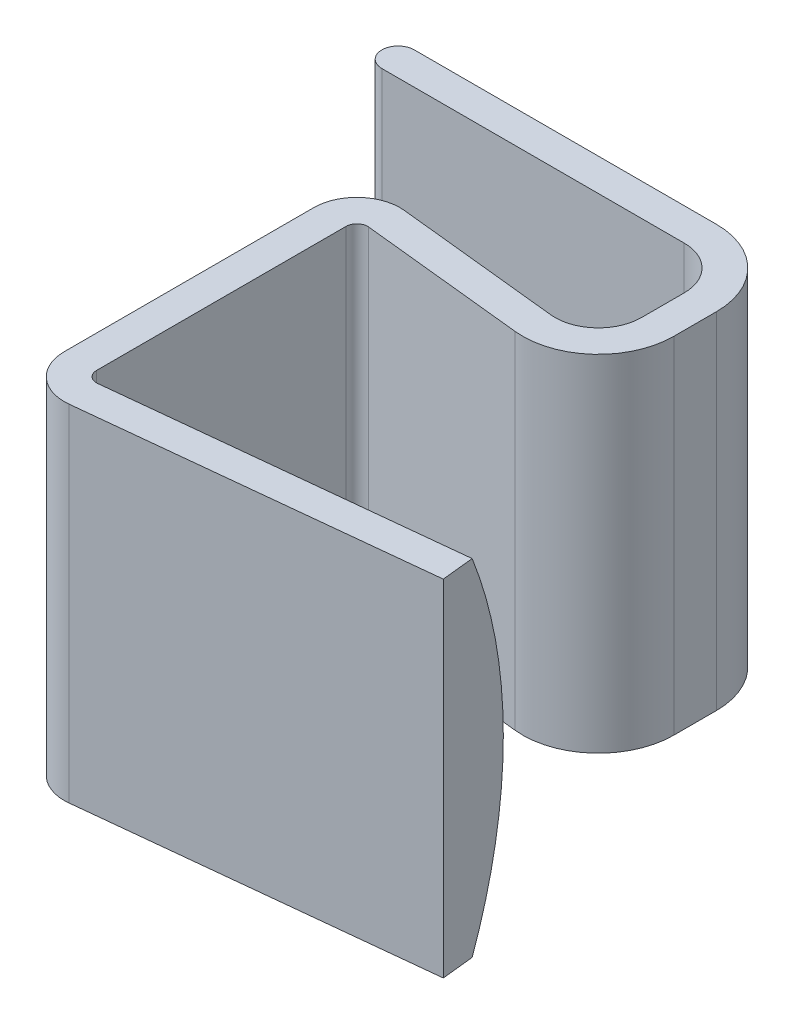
ISO-10303-21;
HEADER;
FILE_DESCRIPTION(('STEP AP214'),'2;1');
FILE_NAME('part.step','',(''),(''),'','','');
FILE_SCHEMA(('AUTOMOTIVE_DESIGN { 1 0 10303 214 1 1 1 1 }'));
ENDSEC;
DATA;
#1=APPLICATION_CONTEXT('core data for automotive mechanical design processes');
#2=APPLICATION_PROTOCOL_DEFINITION('international standard','automotive_design',2000,#1);
#3=PRODUCT_CONTEXT('',#1,'mechanical');
#4=PRODUCT('Part','Part','',(#3));
#5=PRODUCT_RELATED_PRODUCT_CATEGORY('part','',(#4));
#6=PRODUCT_DEFINITION_FORMATION('','',#4);
#7=PRODUCT_DEFINITION_CONTEXT('part definition',#1,'design');
#8=PRODUCT_DEFINITION('design','',#6,#7);
#9=PRODUCT_DEFINITION_SHAPE('','',#8);
#10=(LENGTH_UNIT() NAMED_UNIT(*) SI_UNIT(.MILLI.,.METRE.));
#11=(NAMED_UNIT(*) PLANE_ANGLE_UNIT() SI_UNIT($,.RADIAN.));
#12=(NAMED_UNIT(*) SI_UNIT($,.STERADIAN.) SOLID_ANGLE_UNIT());
#13=UNCERTAINTY_MEASURE_WITH_UNIT(LENGTH_MEASURE(1.E-05),#10,'distance_accuracy_value','');
#14=(GEOMETRIC_REPRESENTATION_CONTEXT(3) GLOBAL_UNCERTAINTY_ASSIGNED_CONTEXT((#13)) GLOBAL_UNIT_ASSIGNED_CONTEXT((#10,
#11,#12)) REPRESENTATION_CONTEXT('',''));
#15=CARTESIAN_POINT('',(0.,0.,0.));
#16=DIRECTION('',(0.,0.,1.));
#17=DIRECTION('',(1.,0.,0.));
#18=AXIS2_PLACEMENT_3D('',#15,#16,#17);
#19=CARTESIAN_POINT('',(19.1345715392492,50.8,8.59003879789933));
#20=DIRECTION('',(0.,-1.,0.));
#21=DIRECTION('',(0.,0.,-1.));
#22=AXIS2_PLACEMENT_3D('',#19,#20,#21);
#23=CYLINDRICAL_SURFACE('',#22,1.5875);
#24=DIRECTION('',(0.,-1.,0.));
#25=VECTOR('',#24,1.);
#26=CARTESIAN_POINT('',(17.5470715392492,50.8,8.59003879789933));
#27=LINE('',#26,#25);
#28=CARTESIAN_POINT('',(17.5470715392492,4.62567107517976,8.59003879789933));
#29=VERTEX_POINT('',#28);
#30=CARTESIAN_POINT('',(17.5470715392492,0.,8.59003879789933));
#31=VERTEX_POINT('',#30);
#32=EDGE_CURVE('E193',#29,#31,#27,.T.);
#33=ORIENTED_EDGE('',*,*,#32,.F.);
#34=CARTESIAN_POINT('',(19.3005104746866,-1.90819582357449E-13,10.1688423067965));
#35=CARTESIAN_POINT('',(19.2619629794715,-9.98065341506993E-05,10.1729373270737));
#36=CARTESIAN_POINT('',(19.2234032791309,0.00335050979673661,10.1755210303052));
#37=CARTESIAN_POINT('',(19.1477266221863,0.0164155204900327,10.1779183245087));
#38=CARTESIAN_POINT('',(19.1105976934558,0.0259531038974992,10.1777659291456));
#39=CARTESIAN_POINT('',(19.0294241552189,0.0532645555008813,10.1746984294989));
#40=CARTESIAN_POINT('',(18.9859000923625,0.0724794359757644,10.171118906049));
#41=CARTESIAN_POINT('',(18.9023247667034,0.117043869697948,10.1610256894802));
#42=CARTESIAN_POINT('',(18.8622929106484,0.142425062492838,10.1544967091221));
#43=CARTESIAN_POINT('',(18.7615667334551,0.215076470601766,10.1344168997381));
#44=CARTESIAN_POINT('',(18.7039118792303,0.266005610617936,10.1190406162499));
#45=CARTESIAN_POINT('',(18.5968204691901,0.374679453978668,10.084744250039));
#46=CARTESIAN_POINT('',(18.5474008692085,0.432437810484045,10.0658170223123));
#47=CARTESIAN_POINT('',(18.453314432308,0.55467142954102,10.0248824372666));
#48=CARTESIAN_POINT('',(18.4089236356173,0.619324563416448,10.0027809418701));
#49=CARTESIAN_POINT('',(18.3259049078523,0.751722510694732,9.95695560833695));
#50=CARTESIAN_POINT('',(18.2872832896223,0.819470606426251,9.93323003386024));
#51=CARTESIAN_POINT('',(18.2147321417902,0.957255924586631,9.88462785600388));
#52=CARTESIAN_POINT('',(18.1808150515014,1.02729863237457,9.85974842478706));
#53=CARTESIAN_POINT('',(18.1170524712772,1.16889013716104,9.80924413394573));
#54=CARTESIAN_POINT('',(18.0872051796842,1.24043825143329,9.78361961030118));
#55=CARTESIAN_POINT('',(18.0166906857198,1.42136800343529,9.71867941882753));
#56=CARTESIAN_POINT('',(17.9782377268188,1.53149033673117,9.67902663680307));
#57=CARTESIAN_POINT('',(17.9078151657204,1.75356389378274,9.59902764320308));
#58=CARTESIAN_POINT('',(17.8758485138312,1.86551592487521,9.55868112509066));
#59=CARTESIAN_POINT('',(17.8173942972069,2.09089137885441,9.47756532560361));
#60=CARTESIAN_POINT('',(17.7909154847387,2.20431685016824,9.4367954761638));
#61=CARTESIAN_POINT('',(17.7427875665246,2.43214349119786,9.3551111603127));
#62=CARTESIAN_POINT('',(17.7211392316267,2.54654481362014,9.31419667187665));
#63=CARTESIAN_POINT('',(17.6625450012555,2.89123285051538,9.19134283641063));
#64=CARTESIAN_POINT('',(17.6320416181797,3.12263337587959,9.10942691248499));
#65=CARTESIAN_POINT('',(17.5853152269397,3.5868984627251,8.94656496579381));
#66=CARTESIAN_POINT('',(17.5690788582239,3.81976144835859,8.8656181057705));
#67=CARTESIAN_POINT('',(17.5550607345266,4.14856023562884,8.75249628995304));
#68=CARTESIAN_POINT('',(17.5520432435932,4.24410691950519,8.71976303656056));
#69=CARTESIAN_POINT('',(17.5480532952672,4.43497746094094,8.65465716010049));
#70=CARTESIAN_POINT('',(17.5470734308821,4.53030086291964,8.62228365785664));
#71=CARTESIAN_POINT('',(17.5470715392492,4.62567107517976,8.59003879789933));
#72=B_SPLINE_CURVE_WITH_KNOTS('',3,(#34,#35,#36,#37,#38,#39,#40,#41,#42,#43,#44,#45,#46,#47,#48,
#49,#50,#51,#52,#53,#54,#55,#56,#57,#58,#59,#60,#61,#62,#63,#64,#65,#66,#67,#68,#69,#70,#71),
.UNSPECIFIED.,.F.,.F.,(4,2,2,2,2,2,2,2,2,2,2,2,2,2,2,2,2,2,4),(0.,0.115877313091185,
0.23031511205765,0.372649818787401,0.515730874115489,0.74975503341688,0.984255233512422,
1.22831934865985,1.47264860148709,1.71761205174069,1.96246670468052,2.33181097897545,
2.70132287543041,3.07141962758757,3.44157539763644,4.1830966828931,4.92392281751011,
5.22703606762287,5.52904552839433),.UNSPECIFIED.);
#73=CARTESIAN_POINT('',(19.3005104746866,0.,10.1688423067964));
#74=VERTEX_POINT('',#73);
#75=EDGE_CURVE('E192',#74,#29,#72,.T.);
#76=ORIENTED_EDGE('',*,*,#75,.F.);
#77=CARTESIAN_POINT('',(19.1345715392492,0.,8.59003879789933));
#78=DIRECTION('',(0.,-1.,0.));
#79=DIRECTION('',(0.,0.,1.));
#80=AXIS2_PLACEMENT_3D('',#77,#78,#79);
#81=CIRCLE('',#80,1.5875);
#82=EDGE_CURVE('E179',#74,#31,#81,.T.);
#83=ORIENTED_EDGE('',*,*,#82,.T.);
#84=EDGE_LOOP('',(#33,#76,#83));
#85=FACE_BOUND('',#84,.T.);
#86=ADVANCED_FACE('F33',(#85),#23,.F.);
#87=CARTESIAN_POINT('',(0.0845715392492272,50.8,-53.219350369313));
#88=DIRECTION('',(0.,-1.,0.));
#89=DIRECTION('',(0.,0.,-1.));
#90=AXIS2_PLACEMENT_3D('',#87,#88,#89);
#91=CYLINDRICAL_SURFACE('',#90,2.38125);
#92=CARTESIAN_POINT('',(0.0845715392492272,0.,-53.219350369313));
#93=DIRECTION('',(0.,1.,0.));
#94=DIRECTION('',(0.,0.,-1.));
#95=AXIS2_PLACEMENT_3D('',#92,#93,#94);
#96=CIRCLE('',#95,2.38125);
#97=CARTESIAN_POINT('',(0.0845715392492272,0.,-55.600600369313));
#98=VERTEX_POINT('',#97);
#99=CARTESIAN_POINT('',(0.0845715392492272,0.,-50.838100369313));
#100=VERTEX_POINT('',#99);
#101=EDGE_CURVE('E284',#98,#100,#96,.T.);
#102=ORIENTED_EDGE('',*,*,#101,.T.);
#103=DIRECTION('',(0.,-1.,0.));
#104=VECTOR('',#103,1.);
#105=CARTESIAN_POINT('',(0.0845715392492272,50.8,-50.838100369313));
#106=LINE('',#105,#104);
#107=CARTESIAN_POINT('',(0.0845715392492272,50.8,-50.838100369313));
#108=VERTEX_POINT('',#107);
#109=EDGE_CURVE('E11',#108,#100,#106,.T.);
#110=ORIENTED_EDGE('',*,*,#109,.F.);
#111=CARTESIAN_POINT('',(0.0845715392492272,50.8,-53.219350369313));
#112=DIRECTION('',(0.,1.,0.));
#113=DIRECTION('',(0.,0.,-1.));
#114=AXIS2_PLACEMENT_3D('',#111,#112,#113);
#115=CIRCLE('',#114,2.38125);
#116=CARTESIAN_POINT('',(0.0845715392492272,50.8,-55.600600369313));
#117=VERTEX_POINT('',#116);
#118=EDGE_CURVE('E219',#117,#108,#115,.T.);
#119=ORIENTED_EDGE('',*,*,#118,.F.);
#120=DIRECTION('',(0.,-1.,0.));
#121=VECTOR('',#120,1.);
#122=CARTESIAN_POINT('',(0.0845715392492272,50.8,-55.600600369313));
#123=LINE('',#122,#121);
#124=EDGE_CURVE('E220',#117,#98,#123,.T.);
#125=ORIENTED_EDGE('',*,*,#124,.T.);
#126=EDGE_LOOP('',(#102,#110,#119,#125));
#127=FACE_BOUND('',#126,.T.);
#128=ADVANCED_FACE('F35',(#127),#91,.T.);
#129=CARTESIAN_POINT('',(0.0845715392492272,50.8,-50.838100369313));
#130=DIRECTION('',(0.,0.,-1.));
#131=DIRECTION('',(-1.,0.,0.));
#132=AXIS2_PLACEMENT_3D('',#129,#130,#131);
#133=PLANE('',#132);
#134=DIRECTION('',(1.,0.,0.));
#135=VECTOR('',#134,1.);
#136=CARTESIAN_POINT('',(0.0845715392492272,0.,-50.838100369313));
#137=LINE('',#136,#135);
#138=CARTESIAN_POINT('',(44.5345715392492,0.,-50.838100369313));
#139=VERTEX_POINT('',#138);
#140=EDGE_CURVE('E278',#100,#139,#137,.T.);
#141=ORIENTED_EDGE('',*,*,#140,.T.);
#142=DIRECTION('',(0.,-1.,0.));
#143=VECTOR('',#142,1.);
#144=CARTESIAN_POINT('',(44.5345715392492,50.8,-50.838100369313));
#145=LINE('',#144,#143);
#146=CARTESIAN_POINT('',(44.5345715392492,50.8,-50.838100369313));
#147=VERTEX_POINT('',#146);
#148=EDGE_CURVE('E41',#147,#139,#145,.T.);
#149=ORIENTED_EDGE('',*,*,#148,.F.);
#150=DIRECTION('',(1.,0.,0.));
#151=VECTOR('',#150,1.);
#152=CARTESIAN_POINT('',(0.0845715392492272,50.8,-50.838100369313));
#153=LINE('',#152,#151);
#154=EDGE_CURVE('E338',#108,#147,#153,.T.);
#155=ORIENTED_EDGE('',*,*,#154,.F.);
#156=ORIENTED_EDGE('',*,*,#109,.T.);
#157=EDGE_LOOP('',(#141,#149,#155,#156));
#158=FACE_BOUND('',#157,.T.);
#159=ADVANCED_FACE('F378',(#158),#133,.F.);
#160=CARTESIAN_POINT('',(44.5345715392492,50.8,-44.488100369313));
#161=DIRECTION('',(0.,-1.,0.));
#162=DIRECTION('',(0.,0.,-1.));
#163=AXIS2_PLACEMENT_3D('',#160,#161,#162);
#164=CYLINDRICAL_SURFACE('',#163,6.35);
#165=CARTESIAN_POINT('',(44.5345715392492,0.,-44.488100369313));
#166=DIRECTION('',(0.,-1.,0.));
#167=DIRECTION('',(0.,0.,-1.));
#168=AXIS2_PLACEMENT_3D('',#165,#166,#167);
#169=CIRCLE('',#168,6.35);
#170=CARTESIAN_POINT('',(50.8845715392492,0.,-44.488100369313));
#171=VERTEX_POINT('',#170);
#172=EDGE_CURVE('E274',#139,#171,#169,.T.);
#173=ORIENTED_EDGE('',*,*,#172,.T.);
#174=DIRECTION('',(0.,-1.,0.));
#175=VECTOR('',#174,1.);
#176=CARTESIAN_POINT('',(50.8845715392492,50.8,-44.488100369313));
#177=LINE('',#176,#175);
#178=CARTESIAN_POINT('',(50.8845715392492,50.8,-44.488100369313));
#179=VERTEX_POINT('',#178);
#180=EDGE_CURVE('E265',#179,#171,#177,.T.);
#181=ORIENTED_EDGE('',*,*,#180,.F.);
#182=CARTESIAN_POINT('',(44.5345715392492,50.8,-44.488100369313));
#183=DIRECTION('',(0.,-1.,0.));
#184=DIRECTION('',(0.,0.,-1.));
#185=AXIS2_PLACEMENT_3D('',#182,#183,#184);
#186=CIRCLE('',#185,6.35);
#187=EDGE_CURVE('E275',#147,#179,#186,.T.);
#188=ORIENTED_EDGE('',*,*,#187,.F.);
#189=ORIENTED_EDGE('',*,*,#148,.T.);
#190=EDGE_LOOP('',(#173,#181,#188,#189));
#191=FACE_BOUND('',#190,.T.);
#192=ADVANCED_FACE('F272',(#191),#164,.F.);
#193=CARTESIAN_POINT('',(50.8845715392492,50.8,-44.488100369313));
#194=DIRECTION('',(1.,0.,0.));
#195=DIRECTION('',(0.,0.,-1.));
#196=AXIS2_PLACEMENT_3D('',#193,#194,#195);
#197=PLANE('',#196);
#198=DIRECTION('',(0.,0.,1.));
#199=VECTOR('',#198,1.);
#200=CARTESIAN_POINT('',(50.8845715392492,0.,-44.488100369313));
#201=LINE('',#200,#199);
#202=CARTESIAN_POINT('',(50.8845715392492,0.,-38.2054898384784));
#203=VERTEX_POINT('',#202);
#204=EDGE_CURVE('E280',#171,#203,#201,.T.);
#205=ORIENTED_EDGE('',*,*,#204,.T.);
#206=DIRECTION('',(0.,-1.,0.));
#207=VECTOR('',#206,1.);
#208=CARTESIAN_POINT('',(50.8845715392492,50.8,-38.2054898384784));
#209=LINE('',#208,#207);
#210=CARTESIAN_POINT('',(50.8845715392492,50.8,-38.2054898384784));
#211=VERTEX_POINT('',#210);
#212=EDGE_CURVE('E262',#211,#203,#209,.T.);
#213=ORIENTED_EDGE('',*,*,#212,.F.);
#214=DIRECTION('',(0.,0.,1.));
#215=VECTOR('',#214,1.);
#216=CARTESIAN_POINT('',(50.8845715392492,50.8,-44.488100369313));
#217=LINE('',#216,#215);
#218=EDGE_CURVE('E341',#179,#211,#217,.T.);
#219=ORIENTED_EDGE('',*,*,#218,.F.);
#220=ORIENTED_EDGE('',*,*,#180,.T.);
#221=EDGE_LOOP('',(#205,#213,#219,#220));
#222=FACE_BOUND('',#221,.T.);
#223=ADVANCED_FACE('F376',(#222),#197,.F.);
#224=CARTESIAN_POINT('',(44.5345715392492,50.8,-38.2054898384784));
#225=DIRECTION('',(0.,-1.,0.));
#226=DIRECTION('',(0.,0.,-1.));
#227=AXIS2_PLACEMENT_3D('',#224,#225,#226);
#228=CYLINDRICAL_SURFACE('',#227,6.35);
#229=CARTESIAN_POINT('',(44.5345715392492,0.,-38.2054898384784));
#230=DIRECTION('',(0.,-1.,0.));
#231=DIRECTION('',(0.,0.,-1.));
#232=AXIS2_PLACEMENT_3D('',#229,#230,#231);
#233=CIRCLE('',#232,6.35);
#234=CARTESIAN_POINT('',(43.8708157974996,0.,-31.8902758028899));
#235=VERTEX_POINT('',#234);
#236=EDGE_CURVE('E282',#203,#235,#233,.T.);
#237=ORIENTED_EDGE('',*,*,#236,.T.);
#238=DIRECTION('',(0.,-1.,0.));
#239=VECTOR('',#238,1.);
#240=CARTESIAN_POINT('',(43.8708157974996,50.8,-31.8902758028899));
#241=LINE('',#240,#239);
#242=CARTESIAN_POINT('',(43.8708157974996,50.8,-31.8902758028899));
#243=VERTEX_POINT('',#242);
#244=EDGE_CURVE('E259',#243,#235,#241,.T.);
#245=ORIENTED_EDGE('',*,*,#244,.F.);
#246=CARTESIAN_POINT('',(44.5345715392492,50.8,-38.2054898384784));
#247=DIRECTION('',(0.,-1.,0.));
#248=DIRECTION('',(0.,0.,-1.));
#249=AXIS2_PLACEMENT_3D('',#246,#247,#248);
#250=CIRCLE('',#249,6.35);
#251=EDGE_CURVE('E343',#211,#243,#250,.T.);
#252=ORIENTED_EDGE('',*,*,#251,.F.);
#253=ORIENTED_EDGE('',*,*,#212,.T.);
#254=EDGE_LOOP('',(#237,#245,#252,#253));
#255=FACE_BOUND('',#254,.T.);
#256=ADVANCED_FACE('F371',(#255),#228,.F.);
#257=CARTESIAN_POINT('',(43.8708157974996,50.8,-31.8902758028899));
#258=DIRECTION('',(-0.104528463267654,0.,0.994521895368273));
#259=DIRECTION('',(0.994521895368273,0.,0.104528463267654));
#260=AXIS2_PLACEMENT_3D('',#257,#258,#259);
#261=PLANE('',#260);
#262=DIRECTION('',(-0.994521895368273,0.,-0.104528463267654));
#263=VECTOR('',#262,1.);
#264=CARTESIAN_POINT('',(43.8708157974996,0.,-31.8902758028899));
#265=LINE('',#264,#263);
#266=CARTESIAN_POINT('',(19.7983272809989,0.,-34.4203962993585));
#267=VERTEX_POINT('',#266);
#268=EDGE_CURVE('E289',#235,#267,#265,.T.);
#269=ORIENTED_EDGE('',*,*,#268,.T.);
#270=DIRECTION('',(0.,-1.,0.));
#271=VECTOR('',#270,1.);
#272=CARTESIAN_POINT('',(19.7983272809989,50.8,-34.4203962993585));
#273=LINE('',#272,#271);
#274=CARTESIAN_POINT('',(19.7983272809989,50.8,-34.4203962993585));
#275=VERTEX_POINT('',#274);
#276=EDGE_CURVE('E256',#275,#267,#273,.T.);
#277=ORIENTED_EDGE('',*,*,#276,.F.);
#278=DIRECTION('',(-0.994521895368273,0.,-0.104528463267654));
#279=VECTOR('',#278,1.);
#280=CARTESIAN_POINT('',(43.8708157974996,50.8,-31.8902758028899));
#281=LINE('',#280,#279);
#282=EDGE_CURVE('E345',#243,#275,#281,.T.);
#283=ORIENTED_EDGE('',*,*,#282,.F.);
#284=ORIENTED_EDGE('',*,*,#244,.T.);
#285=EDGE_LOOP('',(#269,#277,#283,#284));
#286=FACE_BOUND('',#285,.T.);
#287=ADVANCED_FACE('F368',(#286),#261,.F.);
#288=CARTESIAN_POINT('',(19.1345715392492,50.8,-28.1051822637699));
#289=DIRECTION('',(0.,-1.,0.));
#290=DIRECTION('',(0.,0.,-1.));
#291=AXIS2_PLACEMENT_3D('',#288,#289,#290);
#292=CYLINDRICAL_SURFACE('',#291,6.35);
#293=CARTESIAN_POINT('',(19.1345715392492,0.,-28.1051822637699));
#294=DIRECTION('',(0.,1.,0.));
#295=DIRECTION('',(0.,0.,1.));
#296=AXIS2_PLACEMENT_3D('',#293,#294,#295);
#297=CIRCLE('',#296,6.35);
#298=CARTESIAN_POINT('',(12.7845715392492,0.,-28.1051822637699));
#299=VERTEX_POINT('',#298);
#300=EDGE_CURVE('E291',#267,#299,#297,.T.);
#301=ORIENTED_EDGE('',*,*,#300,.T.);
#302=DIRECTION('',(0.,-1.,0.));
#303=VECTOR('',#302,1.);
#304=CARTESIAN_POINT('',(12.7845715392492,50.8,-28.1051822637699));
#305=LINE('',#304,#303);
#306=CARTESIAN_POINT('',(12.7845715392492,50.8,-28.1051822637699));
#307=VERTEX_POINT('',#306);
#308=EDGE_CURVE('E253',#307,#299,#305,.T.);
#309=ORIENTED_EDGE('',*,*,#308,.F.);
#310=CARTESIAN_POINT('',(19.1345715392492,50.8,-28.1051822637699));
#311=DIRECTION('',(0.,1.,0.));
#312=DIRECTION('',(0.,0.,1.));
#313=AXIS2_PLACEMENT_3D('',#310,#311,#312);
#314=CIRCLE('',#313,6.35);
#315=EDGE_CURVE('E347',#275,#307,#314,.T.);
#316=ORIENTED_EDGE('',*,*,#315,.F.);
#317=ORIENTED_EDGE('',*,*,#276,.T.);
#318=EDGE_LOOP('',(#301,#309,#316,#317));
#319=FACE_BOUND('',#318,.T.);
#320=ADVANCED_FACE('F364',(#319),#292,.T.);
#321=CARTESIAN_POINT('',(12.7845715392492,50.8,-28.1051822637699));
#322=DIRECTION('',(1.,0.,0.));
#323=DIRECTION('',(0.,0.,-1.));
#324=AXIS2_PLACEMENT_3D('',#321,#322,#323);
#325=PLANE('',#324);
#326=DIRECTION('',(0.,0.,1.));
#327=VECTOR('',#326,1.);
#328=CARTESIAN_POINT('',(12.7845715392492,0.,-28.1051822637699));
#329=LINE('',#328,#327);
#330=CARTESIAN_POINT('',(12.7845715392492,0.,8.59003879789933));
#331=VERTEX_POINT('',#330);
#332=EDGE_CURVE('E293',#299,#331,#329,.T.);
#333=ORIENTED_EDGE('',*,*,#332,.T.);
#334=DIRECTION('',(0.,-1.,0.));
#335=VECTOR('',#334,1.);
#336=CARTESIAN_POINT('',(12.7845715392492,50.8,8.59003879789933));
#337=LINE('',#336,#335);
#338=CARTESIAN_POINT('',(12.7845715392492,50.8,8.59003879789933));
#339=VERTEX_POINT('',#338);
#340=EDGE_CURVE('E250',#339,#331,#337,.T.);
#341=ORIENTED_EDGE('',*,*,#340,.F.);
#342=DIRECTION('',(0.,0.,1.));
#343=VECTOR('',#342,1.);
#344=CARTESIAN_POINT('',(12.7845715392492,50.8,-28.1051822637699));
#345=LINE('',#344,#343);
#346=EDGE_CURVE('E349',#307,#339,#345,.T.);
#347=ORIENTED_EDGE('',*,*,#346,.F.);
#348=ORIENTED_EDGE('',*,*,#308,.T.);
#349=EDGE_LOOP('',(#333,#341,#347,#348));
#350=FACE_BOUND('',#349,.T.);
#351=ADVANCED_FACE('F360',(#350),#325,.F.);
#352=CARTESIAN_POINT('',(19.1345715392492,50.8,8.59003879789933));
#353=DIRECTION('',(0.,-1.,0.));
#354=DIRECTION('',(0.,0.,-1.));
#355=AXIS2_PLACEMENT_3D('',#352,#353,#354);
#356=CYLINDRICAL_SURFACE('',#355,6.35);
#357=CARTESIAN_POINT('',(19.1345715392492,0.,8.59003879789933));
#358=DIRECTION('',(0.,1.,0.));
#359=DIRECTION('',(0.,0.,1.));
#360=AXIS2_PLACEMENT_3D('',#357,#358,#359);
#361=CIRCLE('',#360,6.35);
#362=CARTESIAN_POINT('',(19.7983272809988,0.,14.9052528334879));
#363=VERTEX_POINT('',#362);
#364=EDGE_CURVE('E295',#331,#363,#361,.T.);
#365=ORIENTED_EDGE('',*,*,#364,.T.);
#366=DIRECTION('',(0.,-1.,0.));
#367=VECTOR('',#366,1.);
#368=CARTESIAN_POINT('',(19.7983272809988,50.8,14.9052528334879));
#369=LINE('',#368,#367);
#370=CARTESIAN_POINT('',(19.7983272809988,50.8,14.9052528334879));
#371=VERTEX_POINT('',#370);
#372=EDGE_CURVE('E247',#371,#363,#369,.T.);
#373=ORIENTED_EDGE('',*,*,#372,.F.);
#374=CARTESIAN_POINT('',(19.1345715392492,50.8,8.59003879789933));
#375=DIRECTION('',(0.,1.,0.));
#376=DIRECTION('',(0.,0.,1.));
#377=AXIS2_PLACEMENT_3D('',#374,#375,#376);
#378=CIRCLE('',#377,6.35);
#379=EDGE_CURVE('E313',#339,#371,#378,.T.);
#380=ORIENTED_EDGE('',*,*,#379,.F.);
#381=ORIENTED_EDGE('',*,*,#340,.T.);
#382=EDGE_LOOP('',(#365,#373,#380,#381));
#383=FACE_BOUND('',#382,.T.);
#384=ADVANCED_FACE('F355',(#383),#356,.T.);
#385=CARTESIAN_POINT('',(19.7983272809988,50.8,14.9052528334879));
#386=DIRECTION('',(-0.104528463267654,0.,-0.994521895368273));
#387=DIRECTION('',(-0.994521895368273,0.,0.104528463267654));
#388=AXIS2_PLACEMENT_3D('',#385,#386,#387);
#389=PLANE('',#388);
#390=DIRECTION('',(0.994521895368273,0.,-0.104528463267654));
#391=VECTOR('',#390,1.);
#392=CARTESIAN_POINT('',(19.7983272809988,0.,14.9052528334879));
#393=LINE('',#392,#391);
#394=CARTESIAN_POINT('',(69.621497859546,0.,9.66862659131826));
#395=VERTEX_POINT('',#394);
#396=EDGE_CURVE('E202',#363,#395,#393,.T.);
#397=ORIENTED_EDGE('',*,*,#396,.T.);
#398=DIRECTION('',(0.,-1.,0.));
#399=VECTOR('',#398,1.);
#400=CARTESIAN_POINT('',(69.621497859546,50.8,9.66862659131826));
#401=LINE('',#400,#399);
#402=CARTESIAN_POINT('',(69.621497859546,50.8,9.66862659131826));
#403=VERTEX_POINT('',#402);
#404=EDGE_CURVE('E244',#403,#395,#401,.T.);
#405=ORIENTED_EDGE('',*,*,#404,.F.);
#406=DIRECTION('',(0.994521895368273,0.,-0.104528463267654));
#407=VECTOR('',#406,1.);
#408=CARTESIAN_POINT('',(19.7983272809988,50.8,14.9052528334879));
#409=LINE('',#408,#407);
#410=EDGE_CURVE('E309',#371,#403,#409,.T.);
#411=ORIENTED_EDGE('',*,*,#410,.F.);
#412=ORIENTED_EDGE('',*,*,#372,.T.);
#413=EDGE_LOOP('',(#397,#405,#411,#412));
#414=FACE_BOUND('',#413,.T.);
#415=ADVANCED_FACE('F299',(#414),#389,.F.);
#416=CARTESIAN_POINT('',(69.1236810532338,50.8,4.93221606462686));
#417=DIRECTION('',(-0.994521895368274,0.,0.104528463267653));
#418=DIRECTION('',(0.104528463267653,0.,0.994521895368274));
#419=AXIS2_PLACEMENT_3D('',#416,#417,#418);
#420=PLANE('',#419);
#421=DIRECTION('',(-0.104528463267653,0.,-0.994521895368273));
#422=VECTOR('',#421,1.);
#423=CARTESIAN_POINT('',(69.1236810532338,0.,4.93221606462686));
#424=LINE('',#423,#422);
#425=CARTESIAN_POINT('',(69.1236810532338,0.,4.93221606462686));
#426=VERTEX_POINT('',#425);
#427=EDGE_CURVE('E200',#395,#426,#424,.T.);
#428=ORIENTED_EDGE('',*,*,#427,.T.);
#429=CARTESIAN_POINT('',(75.3983706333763,25.4,64.6318995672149));
#430=DIRECTION('',(0.994521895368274,0.,-0.104528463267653));
#431=DIRECTION('',(0.104528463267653,0.,0.994521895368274));
#432=AXIS2_PLACEMENT_3D('',#429,#430,#431);
#433=CIRCLE('',#432,65.1811624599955);
#434=CARTESIAN_POINT('',(69.1236810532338,50.8,4.93221606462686));
#435=VERTEX_POINT('',#434);
#436=EDGE_CURVE('E199',#426,#435,#433,.T.);
#437=ORIENTED_EDGE('',*,*,#436,.T.);
#438=DIRECTION('',(-0.104528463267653,0.,-0.994521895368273));
#439=VECTOR('',#438,1.);
#440=CARTESIAN_POINT('',(69.1236810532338,50.8,4.93221606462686));
#441=LINE('',#440,#439);
#442=EDGE_CURVE('E306',#403,#435,#441,.T.);
#443=ORIENTED_EDGE('',*,*,#442,.F.);
#444=ORIENTED_EDGE('',*,*,#404,.T.);
#445=EDGE_LOOP('',(#428,#437,#443,#444));
#446=FACE_BOUND('',#445,.T.);
#447=ADVANCED_FACE('F305',(#446),#420,.F.);
#448=CARTESIAN_POINT('',(19.1345715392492,50.8,8.59003879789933));
#449=DIRECTION('',(0.,-1.,0.));
#450=DIRECTION('',(0.,0.,1.));
#451=AXIS2_PLACEMENT_3D('',#448,#449,#450);
#452=CIRCLE('',#451,1.5875);
#453=CARTESIAN_POINT('',(19.3005104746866,50.8,10.1688423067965));
#454=VERTEX_POINT('',#453);
#455=CARTESIAN_POINT('',(17.5470715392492,50.8,8.59003879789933));
#456=VERTEX_POINT('',#455);
#457=EDGE_CURVE('E311',#454,#456,#452,.T.);
#458=ORIENTED_EDGE('',*,*,#457,.F.);
#459=CARTESIAN_POINT('',(17.5470715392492,46.1743289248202,8.59003879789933));
#460=CARTESIAN_POINT('',(17.5470825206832,46.3004961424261,8.63269490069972));
#461=CARTESIAN_POINT('',(17.5487915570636,46.4265908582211,8.67558143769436));
#462=CARTESIAN_POINT('',(17.5557923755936,46.6785644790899,8.76177114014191));
#463=CARTESIAN_POINT('',(17.5610848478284,46.8044433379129,8.80507438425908));
#464=CARTESIAN_POINT('',(17.5754764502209,47.0565162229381,8.89226177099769));
#465=CARTESIAN_POINT('',(17.584595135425,47.1827085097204,8.93614775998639));
#466=CARTESIAN_POINT('',(17.606918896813,47.4346260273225,9.02420187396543));
#467=CARTESIAN_POINT('',(17.6201236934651,47.5603512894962,9.06836997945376));
#468=CARTESIAN_POINT('',(17.6510195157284,47.811476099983,9.15699312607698));
#469=CARTESIAN_POINT('',(17.6687205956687,47.9368742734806,9.20144858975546));
#470=CARTESIAN_POINT('',(17.709081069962,48.1868500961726,9.29041017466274));
#471=CARTESIAN_POINT('',(17.7317400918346,48.3114278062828,9.3349162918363));
#472=CARTESIAN_POINT('',(17.7826200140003,48.5592387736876,9.42370359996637));
#473=CARTESIAN_POINT('',(17.8108296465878,48.6824742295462,9.46798506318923));
#474=CARTESIAN_POINT('',(17.8737157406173,48.927414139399,9.55613151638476));
#475=CARTESIAN_POINT('',(17.9083897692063,49.0491191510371,9.59999665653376));
#476=CARTESIAN_POINT('',(17.9635996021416,49.2219057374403,9.66223693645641));
#477=CARTESIAN_POINT('',(17.9809933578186,49.2738742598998,9.68095205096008));
#478=CARTESIAN_POINT('',(18.0173710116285,49.3773274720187,9.71817693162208));
#479=CARTESIAN_POINT('',(18.0363550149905,49.428812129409,9.73668668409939));
#480=CARTESIAN_POINT('',(18.0960228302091,49.5826839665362,9.79192533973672));
#481=CARTESIAN_POINT('',(18.1393403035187,49.6842263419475,9.82826879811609));
#482=CARTESIAN_POINT('',(18.2145755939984,49.8416969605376,9.88423222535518));
#483=CARTESIAN_POINT('',(18.2435977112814,49.8988037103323,9.90444163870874));
#484=CARTESIAN_POINT('',(18.3050235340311,50.0114499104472,9.94404927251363));
#485=CARTESIAN_POINT('',(18.3374259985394,50.0669899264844,9.96344778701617));
#486=CARTESIAN_POINT('',(18.406079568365,50.1757559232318,10.0010606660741));
#487=CARTESIAN_POINT('',(18.4423154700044,50.2289899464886,10.0192792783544));
#488=CARTESIAN_POINT('',(18.5194644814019,50.3324648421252,10.0541400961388));
#489=CARTESIAN_POINT('',(18.5603719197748,50.382709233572,10.0707841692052));
#490=CARTESIAN_POINT('',(18.638662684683,50.4687533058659,10.0985389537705));
#491=CARTESIAN_POINT('',(18.6749842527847,50.5053716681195,10.1100779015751));
#492=CARTESIAN_POINT('',(18.7517744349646,50.5748477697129,10.1312108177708));
#493=CARTESIAN_POINT('',(18.7922503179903,50.6076986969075,10.1408012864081));
#494=CARTESIAN_POINT('',(18.8783816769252,50.6683376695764,10.157354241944));
#495=CARTESIAN_POINT('',(18.924106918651,50.6960405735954,10.1642742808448));
#496=CARTESIAN_POINT('',(19.0199570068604,50.7430299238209,10.1741175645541));
#497=CARTESIAN_POINT('',(19.0700522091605,50.7623684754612,10.1770658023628));
#498=CARTESIAN_POINT('',(19.1507236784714,50.7838660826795,10.1777230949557));
#499=CARTESIAN_POINT('',(19.1802821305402,50.7898392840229,10.1771565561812));
#500=CARTESIAN_POINT('',(19.2400743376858,50.7979405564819,10.1743181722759));
#501=CARTESIAN_POINT('',(19.2703115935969,50.8000376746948,10.1720328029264));
#502=CARTESIAN_POINT('',(19.3005104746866,50.8000000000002,10.1688423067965));
#503=B_SPLINE_CURVE_WITH_KNOTS('',3,(#459,#460,#461,#462,#463,#464,#465,#466,#467,#468,#469,
#470,#471,#472,#473,#474,#475,#476,#477,#478,#479,#480,#481,#482,#483,#484,#485,#486,#487,#488,
#489,#490,#491,#492,#493,#494,#495,#496,#497,#498,#499,#500,#501,#502),.UNSPECIFIED.,.F.,.F.,(4,
2,2,2,2,2,2,2,2,2,2,2,2,2,2,2,2,2,2,2,2,4),(0.,0.399545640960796,0.799168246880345,
1.20085861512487,1.60252150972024,2.0050906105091,2.40762947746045,2.80935947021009,
3.21093857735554,3.38464537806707,3.5583636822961,3.90667234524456,4.10810270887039,
4.30945938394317,4.51004544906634,4.71039053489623,4.86869538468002,5.02728210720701,
5.18829492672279,5.34828974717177,5.43849258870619,5.52941269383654),.UNSPECIFIED.);
#504=CARTESIAN_POINT('',(17.5470715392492,46.1743289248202,8.59003879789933));
#505=VERTEX_POINT('',#504);
#506=EDGE_CURVE('E56',#505,#454,#503,.T.);
#507=ORIENTED_EDGE('',*,*,#506,.F.);
#508=EDGE_CURVE('E242',#456,#505,#27,.T.);
#509=ORIENTED_EDGE('',*,*,#508,.F.);
#510=EDGE_LOOP('',(#458,#507,#509));
#511=FACE_BOUND('',#510,.T.);
#512=ADVANCED_FACE('F411',(#511),#23,.F.);
#513=CARTESIAN_POINT('',(17.5470715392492,50.8,-28.1051822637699));
#514=DIRECTION('',(-1.,0.,0.));
#515=DIRECTION('',(0.,0.,1.));
#516=AXIS2_PLACEMENT_3D('',#513,#514,#515);
#517=PLANE('',#516);
#518=ORIENTED_EDGE('',*,*,#508,.T.);
#519=CARTESIAN_POINT('',(17.5470715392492,25.4,70.712316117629));
#520=DIRECTION('',(-1.,0.,0.));
#521=DIRECTION('',(0.,0.,-1.));
#522=AXIS2_PLACEMENT_3D('',#519,#520,#521);
#523=ELLIPSE('',#522,65.5401985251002,65.1811624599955);
#524=EDGE_CURVE('E48',#29,#505,#523,.F.);
#525=ORIENTED_EDGE('',*,*,#524,.F.);
#526=ORIENTED_EDGE('',*,*,#32,.T.);
#527=DIRECTION('',(0.,0.,-1.));
#528=VECTOR('',#527,1.);
#529=CARTESIAN_POINT('',(17.5470715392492,0.,-28.1051822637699));
#530=LINE('',#529,#528);
#531=CARTESIAN_POINT('',(17.5470715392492,0.,-28.1051822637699));
#532=VERTEX_POINT('',#531);
#533=EDGE_CURVE('E188',#31,#532,#530,.T.);
#534=ORIENTED_EDGE('',*,*,#533,.T.);
#535=DIRECTION('',(0.,-1.,0.));
#536=VECTOR('',#535,1.);
#537=CARTESIAN_POINT('',(17.5470715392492,50.8,-28.1051822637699));
#538=LINE('',#537,#536);
#539=CARTESIAN_POINT('',(17.5470715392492,50.8,-28.1051822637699));
#540=VERTEX_POINT('',#539);
#541=EDGE_CURVE('E239',#540,#532,#538,.T.);
#542=ORIENTED_EDGE('',*,*,#541,.F.);
#543=DIRECTION('',(0.,0.,-1.));
#544=VECTOR('',#543,1.);
#545=CARTESIAN_POINT('',(17.5470715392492,50.8,-28.1051822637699));
#546=LINE('',#545,#544);
#547=EDGE_CURVE('E318',#456,#540,#546,.T.);
#548=ORIENTED_EDGE('',*,*,#547,.F.);
#549=EDGE_LOOP('',(#518,#525,#526,#534,#542,#548));
#550=FACE_BOUND('',#549,.T.);
#551=ADVANCED_FACE('F410',(#550),#517,.F.);
#552=CARTESIAN_POINT('',(19.1345715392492,50.8,-28.1051822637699));
#553=DIRECTION('',(0.,-1.,0.));
#554=DIRECTION('',(0.,0.,-1.));
#555=AXIS2_PLACEMENT_3D('',#552,#553,#554);
#556=CYLINDRICAL_SURFACE('',#555,1.5875);
#557=CARTESIAN_POINT('',(19.1345715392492,0.,-28.1051822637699));
#558=DIRECTION('',(0.,-1.,0.));
#559=DIRECTION('',(0.,0.,1.));
#560=AXIS2_PLACEMENT_3D('',#557,#558,#559);
#561=CIRCLE('',#560,1.5875);
#562=CARTESIAN_POINT('',(19.3005104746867,0.,-29.6839857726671));
#563=VERTEX_POINT('',#562);
#564=EDGE_CURVE('E207',#532,#563,#561,.T.);
#565=ORIENTED_EDGE('',*,*,#564,.T.);
#566=DIRECTION('',(0.,-1.,0.));
#567=VECTOR('',#566,1.);
#568=CARTESIAN_POINT('',(19.3005104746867,50.8,-29.6839857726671));
#569=LINE('',#568,#567);
#570=CARTESIAN_POINT('',(19.3005104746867,50.8,-29.6839857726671));
#571=VERTEX_POINT('',#570);
#572=EDGE_CURVE('E236',#571,#563,#569,.T.);
#573=ORIENTED_EDGE('',*,*,#572,.F.);
#574=CARTESIAN_POINT('',(19.1345715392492,50.8,-28.1051822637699));
#575=DIRECTION('',(0.,-1.,0.));
#576=DIRECTION('',(0.,0.,1.));
#577=AXIS2_PLACEMENT_3D('',#574,#575,#576);
#578=CIRCLE('',#577,1.5875);
#579=EDGE_CURVE('E320',#540,#571,#578,.T.);
#580=ORIENTED_EDGE('',*,*,#579,.F.);
#581=ORIENTED_EDGE('',*,*,#541,.T.);
#582=EDGE_LOOP('',(#565,#573,#580,#581));
#583=FACE_BOUND('',#582,.T.);
#584=ADVANCED_FACE('F407',(#583),#556,.F.);
#585=CARTESIAN_POINT('',(43.3729989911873,50.8,-27.1538652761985));
#586=DIRECTION('',(0.104528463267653,0.,-0.994521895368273));
#587=DIRECTION('',(-0.994521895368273,0.,-0.104528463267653));
#588=AXIS2_PLACEMENT_3D('',#585,#586,#587);
#589=PLANE('',#588);
#590=DIRECTION('',(0.994521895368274,0.,0.104528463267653));
#591=VECTOR('',#590,1.);
#592=CARTESIAN_POINT('',(43.3729989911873,0.,-27.1538652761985));
#593=LINE('',#592,#591);
#594=CARTESIAN_POINT('',(43.3729989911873,0.,-27.1538652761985));
#595=VERTEX_POINT('',#594);
#596=EDGE_CURVE('E209',#563,#595,#593,.T.);
#597=ORIENTED_EDGE('',*,*,#596,.T.);
#598=DIRECTION('',(0.,-1.,0.));
#599=VECTOR('',#598,1.);
#600=CARTESIAN_POINT('',(43.3729989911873,50.8,-27.1538652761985));
#601=LINE('',#600,#599);
#602=CARTESIAN_POINT('',(43.3729989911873,50.8,-27.1538652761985));
#603=VERTEX_POINT('',#602);
#604=EDGE_CURVE('E233',#603,#595,#601,.T.);
#605=ORIENTED_EDGE('',*,*,#604,.F.);
#606=DIRECTION('',(0.994521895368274,0.,0.104528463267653));
#607=VECTOR('',#606,1.);
#608=CARTESIAN_POINT('',(43.3729989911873,50.8,-27.1538652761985));
#609=LINE('',#608,#607);
#610=EDGE_CURVE('E322',#571,#603,#609,.T.);
#611=ORIENTED_EDGE('',*,*,#610,.F.);
#612=ORIENTED_EDGE('',*,*,#572,.T.);
#613=EDGE_LOOP('',(#597,#605,#611,#612));
#614=FACE_BOUND('',#613,.T.);
#615=ADVANCED_FACE('F403',(#614),#589,.F.);
#616=CARTESIAN_POINT('',(44.5345715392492,50.8,-38.2054898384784));
#617=DIRECTION('',(0.,-1.,0.));
#618=DIRECTION('',(0.,0.,-1.));
#619=AXIS2_PLACEMENT_3D('',#616,#617,#618);
#620=CYLINDRICAL_SURFACE('',#619,11.1125);
#621=CARTESIAN_POINT('',(44.5345715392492,0.,-38.2054898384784));
#622=DIRECTION('',(0.,1.,0.));
#623=DIRECTION('',(0.,0.,-1.));
#624=AXIS2_PLACEMENT_3D('',#621,#622,#623);
#625=CIRCLE('',#624,11.1125);
#626=CARTESIAN_POINT('',(55.6470715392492,0.,-38.2054898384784));
#627=VERTEX_POINT('',#626);
#628=EDGE_CURVE('E211',#595,#627,#625,.T.);
#629=ORIENTED_EDGE('',*,*,#628,.T.);
#630=DIRECTION('',(0.,-1.,0.));
#631=VECTOR('',#630,1.);
#632=CARTESIAN_POINT('',(55.6470715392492,50.8,-38.2054898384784));
#633=LINE('',#632,#631);
#634=CARTESIAN_POINT('',(55.6470715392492,50.8,-38.2054898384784));
#635=VERTEX_POINT('',#634);
#636=EDGE_CURVE('E230',#635,#627,#633,.T.);
#637=ORIENTED_EDGE('',*,*,#636,.F.);
#638=CARTESIAN_POINT('',(44.5345715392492,50.8,-38.2054898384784));
#639=DIRECTION('',(0.,1.,0.));
#640=DIRECTION('',(0.,0.,-1.));
#641=AXIS2_PLACEMENT_3D('',#638,#639,#640);
#642=CIRCLE('',#641,11.1125);
#643=EDGE_CURVE('E324',#603,#635,#642,.T.);
#644=ORIENTED_EDGE('',*,*,#643,.F.);
#645=ORIENTED_EDGE('',*,*,#604,.T.);
#646=EDGE_LOOP('',(#629,#637,#644,#645));
#647=FACE_BOUND('',#646,.T.);
#648=ADVANCED_FACE('F398',(#647),#620,.T.);
#649=CARTESIAN_POINT('',(55.6470715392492,50.8,-44.4881003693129));
#650=DIRECTION('',(-1.,0.,0.));
#651=DIRECTION('',(0.,0.,1.));
#652=AXIS2_PLACEMENT_3D('',#649,#650,#651);
#653=PLANE('',#652);
#654=DIRECTION('',(0.,0.,-1.));
#655=VECTOR('',#654,1.);
#656=CARTESIAN_POINT('',(55.6470715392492,0.,-44.4881003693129));
#657=LINE('',#656,#655);
#658=CARTESIAN_POINT('',(55.6470715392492,0.,-44.4881003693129));
#659=VERTEX_POINT('',#658);
#660=EDGE_CURVE('E213',#627,#659,#657,.T.);
#661=ORIENTED_EDGE('',*,*,#660,.T.);
#662=DIRECTION('',(0.,-1.,0.));
#663=VECTOR('',#662,1.);
#664=CARTESIAN_POINT('',(55.6470715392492,50.8,-44.4881003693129));
#665=LINE('',#664,#663);
#666=CARTESIAN_POINT('',(55.6470715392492,50.8,-44.4881003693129));
#667=VERTEX_POINT('',#666);
#668=EDGE_CURVE('E227',#667,#659,#665,.T.);
#669=ORIENTED_EDGE('',*,*,#668,.F.);
#670=DIRECTION('',(0.,0.,-1.));
#671=VECTOR('',#670,1.);
#672=CARTESIAN_POINT('',(55.6470715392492,50.8,-44.4881003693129));
#673=LINE('',#672,#671);
#674=EDGE_CURVE('E326',#635,#667,#673,.T.);
#675=ORIENTED_EDGE('',*,*,#674,.F.);
#676=ORIENTED_EDGE('',*,*,#636,.T.);
#677=EDGE_LOOP('',(#661,#669,#675,#676));
#678=FACE_BOUND('',#677,.T.);
#679=ADVANCED_FACE('F393',(#678),#653,.F.);
#680=CARTESIAN_POINT('',(44.5345715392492,50.8,-44.488100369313));
#681=DIRECTION('',(0.,-1.,0.));
#682=DIRECTION('',(0.,0.,-1.));
#683=AXIS2_PLACEMENT_3D('',#680,#681,#682);
#684=CYLINDRICAL_SURFACE('',#683,11.1125);
#685=CARTESIAN_POINT('',(44.5345715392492,0.,-44.488100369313));
#686=DIRECTION('',(0.,1.,0.));
#687=DIRECTION('',(0.,0.,-1.));
#688=AXIS2_PLACEMENT_3D('',#685,#686,#687);
#689=CIRCLE('',#688,11.1125);
#690=CARTESIAN_POINT('',(44.5345715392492,0.,-55.600600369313));
#691=VERTEX_POINT('',#690);
#692=EDGE_CURVE('E215',#659,#691,#689,.T.);
#693=ORIENTED_EDGE('',*,*,#692,.T.);
#694=DIRECTION('',(0.,-1.,0.));
#695=VECTOR('',#694,1.);
#696=CARTESIAN_POINT('',(44.5345715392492,50.8,-55.600600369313));
#697=LINE('',#696,#695);
#698=CARTESIAN_POINT('',(44.5345715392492,50.8,-55.600600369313));
#699=VERTEX_POINT('',#698);
#700=EDGE_CURVE('E223',#699,#691,#697,.T.);
#701=ORIENTED_EDGE('',*,*,#700,.F.);
#702=CARTESIAN_POINT('',(44.5345715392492,50.8,-44.488100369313));
#703=DIRECTION('',(0.,1.,0.));
#704=DIRECTION('',(0.,0.,-1.));
#705=AXIS2_PLACEMENT_3D('',#702,#703,#704);
#706=CIRCLE('',#705,11.1125);
#707=EDGE_CURVE('E328',#667,#699,#706,.T.);
#708=ORIENTED_EDGE('',*,*,#707,.F.);
#709=ORIENTED_EDGE('',*,*,#668,.T.);
#710=EDGE_LOOP('',(#693,#701,#708,#709));
#711=FACE_BOUND('',#710,.T.);
#712=ADVANCED_FACE('F389',(#711),#684,.T.);
#713=CARTESIAN_POINT('',(0.0845715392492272,50.8,-55.600600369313));
#714=DIRECTION('',(0.,0.,1.));
#715=DIRECTION('',(1.,0.,0.));
#716=AXIS2_PLACEMENT_3D('',#713,#714,#715);
#717=PLANE('',#716);
#718=DIRECTION('',(-1.,0.,0.));
#719=VECTOR('',#718,1.);
#720=CARTESIAN_POINT('',(0.0845715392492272,0.,-55.600600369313));
#721=LINE('',#720,#719);
#722=EDGE_CURVE('E217',#691,#98,#721,.T.);
#723=ORIENTED_EDGE('',*,*,#722,.T.);
#724=ORIENTED_EDGE('',*,*,#124,.F.);
#725=DIRECTION('',(-1.,0.,0.));
#726=VECTOR('',#725,1.);
#727=CARTESIAN_POINT('',(0.0845715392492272,50.8,-55.600600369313));
#728=LINE('',#727,#726);
#729=EDGE_CURVE('E224',#699,#117,#728,.T.);
#730=ORIENTED_EDGE('',*,*,#729,.F.);
#731=ORIENTED_EDGE('',*,*,#700,.T.);
#732=EDGE_LOOP('',(#723,#724,#730,#731));
#733=FACE_BOUND('',#732,.T.);
#734=ADVANCED_FACE('F385',(#733),#717,.F.);
#735=CARTESIAN_POINT('',(0.0845715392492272,50.8,-53.219350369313));
#736=DIRECTION('',(0.,-1.,0.));
#737=DIRECTION('',(0.,0.,-1.));
#738=AXIS2_PLACEMENT_3D('',#735,#736,#737);
#739=PLANE('',#738);
#740=ORIENTED_EDGE('',*,*,#118,.T.);
#741=ORIENTED_EDGE('',*,*,#154,.T.);
#742=ORIENTED_EDGE('',*,*,#187,.T.);
#743=ORIENTED_EDGE('',*,*,#218,.T.);
#744=ORIENTED_EDGE('',*,*,#251,.T.);
#745=ORIENTED_EDGE('',*,*,#282,.T.);
#746=ORIENTED_EDGE('',*,*,#315,.T.);
#747=ORIENTED_EDGE('',*,*,#346,.T.);
#748=ORIENTED_EDGE('',*,*,#379,.T.);
#749=ORIENTED_EDGE('',*,*,#410,.T.);
#750=ORIENTED_EDGE('',*,*,#442,.T.);
#751=DIRECTION('',(-0.994521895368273,0.,0.104528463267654));
#752=VECTOR('',#751,1.);
#753=CARTESIAN_POINT('',(19.3005104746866,50.8,10.1688423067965));
#754=LINE('',#753,#752);
#755=EDGE_CURVE('E308',#435,#454,#754,.T.);
#756=ORIENTED_EDGE('',*,*,#755,.T.);
#757=ORIENTED_EDGE('',*,*,#457,.T.);
#758=ORIENTED_EDGE('',*,*,#547,.T.);
#759=ORIENTED_EDGE('',*,*,#579,.T.);
#760=ORIENTED_EDGE('',*,*,#610,.T.);
#761=ORIENTED_EDGE('',*,*,#643,.T.);
#762=ORIENTED_EDGE('',*,*,#674,.T.);
#763=ORIENTED_EDGE('',*,*,#707,.T.);
#764=ORIENTED_EDGE('',*,*,#729,.T.);
#765=EDGE_LOOP('',(#740,#741,#742,#743,#744,#745,#746,#747,#748,#749,#750,#756,#757,#758,#759,
#760,#761,#762,#763,#764));
#766=FACE_BOUND('',#765,.T.);
#767=ADVANCED_FACE('F351',(#766),#739,.F.);
#768=CARTESIAN_POINT('',(0.0845715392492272,0.,-53.219350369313));
#769=DIRECTION('',(0.,-1.,0.));
#770=DIRECTION('',(0.,0.,-1.));
#771=AXIS2_PLACEMENT_3D('',#768,#769,#770);
#772=PLANE('',#771);
#773=ORIENTED_EDGE('',*,*,#101,.F.);
#774=ORIENTED_EDGE('',*,*,#722,.F.);
#775=ORIENTED_EDGE('',*,*,#692,.F.);
#776=ORIENTED_EDGE('',*,*,#660,.F.);
#777=ORIENTED_EDGE('',*,*,#628,.F.);
#778=ORIENTED_EDGE('',*,*,#596,.F.);
#779=ORIENTED_EDGE('',*,*,#564,.F.);
#780=ORIENTED_EDGE('',*,*,#533,.F.);
#781=ORIENTED_EDGE('',*,*,#82,.F.);
#782=DIRECTION('',(-0.994521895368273,0.,0.104528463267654));
#783=VECTOR('',#782,1.);
#784=CARTESIAN_POINT('',(19.3005104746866,0.,10.1688423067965));
#785=LINE('',#784,#783);
#786=EDGE_CURVE('E185',#426,#74,#785,.T.);
#787=ORIENTED_EDGE('',*,*,#786,.F.);
#788=ORIENTED_EDGE('',*,*,#427,.F.);
#789=ORIENTED_EDGE('',*,*,#396,.F.);
#790=ORIENTED_EDGE('',*,*,#364,.F.);
#791=ORIENTED_EDGE('',*,*,#332,.F.);
#792=ORIENTED_EDGE('',*,*,#300,.F.);
#793=ORIENTED_EDGE('',*,*,#268,.F.);
#794=ORIENTED_EDGE('',*,*,#236,.F.);
#795=ORIENTED_EDGE('',*,*,#204,.F.);
#796=ORIENTED_EDGE('',*,*,#172,.F.);
#797=ORIENTED_EDGE('',*,*,#140,.F.);
#798=EDGE_LOOP('',(#773,#774,#775,#776,#777,#778,#779,#780,#781,#787,#788,#789,#790,#791,#792,
#793,#794,#795,#796,#797));
#799=FACE_BOUND('',#798,.T.);
#800=ADVANCED_FACE('F182',(#799),#772,.T.);
#801=CARTESIAN_POINT('',(10.788597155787,25.4,71.4226603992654));
#802=DIRECTION('',(0.994521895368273,0.,-0.104528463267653));
#803=DIRECTION('',(-0.104528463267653,0.,-0.994521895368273));
#804=AXIS2_PLACEMENT_3D('',#801,#802,#803);
#805=CYLINDRICAL_SURFACE('',#804,65.1811624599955);
#806=ORIENTED_EDGE('',*,*,#524,.T.);
#807=ORIENTED_EDGE('',*,*,#506,.T.);
#808=ORIENTED_EDGE('',*,*,#755,.F.);
#809=ORIENTED_EDGE('',*,*,#436,.F.);
#810=ORIENTED_EDGE('',*,*,#786,.T.);
#811=ORIENTED_EDGE('',*,*,#75,.T.);
#812=EDGE_LOOP('',(#806,#807,#808,#809,#810,#811));
#813=FACE_BOUND('',#812,.T.);
#814=ADVANCED_FACE('F196',(#813),#805,.T.);
#815=CLOSED_SHELL('',(#86,#128,#159,#192,#223,#256,#287,#320,#351,#384,#415,#447,#512,#551,#584,
#615,#648,#679,#712,#734,#767,#800,#814));
#816=MANIFOLD_SOLID_BREP('B2',#815);
#817=ADVANCED_BREP_SHAPE_REPRESENTATION('',(#18,#816),#14);
#818=SHAPE_DEFINITION_REPRESENTATION(#9,#817);
ENDSEC;
END-ISO-10303-21;
